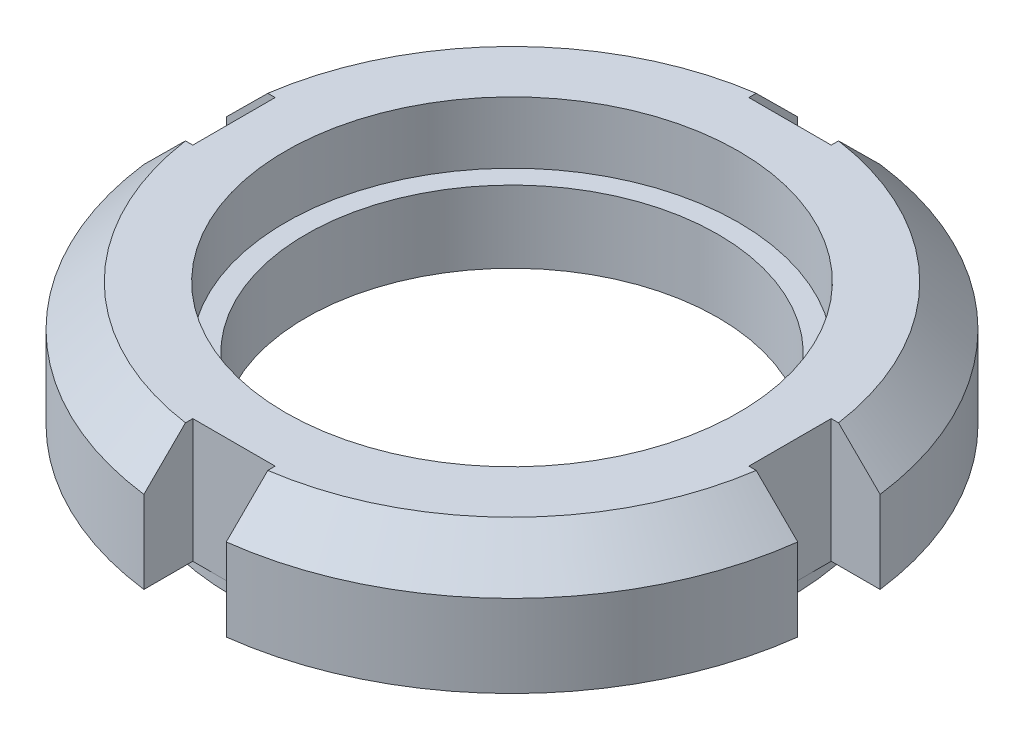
ISO-10303-21;
HEADER;
FILE_DESCRIPTION(('STEP AP214'),'2;1');
FILE_NAME('part.step','',(''),(''),'','','');
FILE_SCHEMA(('AUTOMOTIVE_DESIGN { 1 0 10303 214 1 1 1 1 }'));
ENDSEC;
DATA;
#1=APPLICATION_CONTEXT('core data for automotive mechanical design processes');
#2=APPLICATION_PROTOCOL_DEFINITION('international standard','automotive_design',2000,#1);
#3=PRODUCT_CONTEXT('',#1,'mechanical');
#4=PRODUCT('Part','Part','',(#3));
#5=PRODUCT_RELATED_PRODUCT_CATEGORY('part','',(#4));
#6=PRODUCT_DEFINITION_FORMATION('','',#4);
#7=PRODUCT_DEFINITION_CONTEXT('part definition',#1,'design');
#8=PRODUCT_DEFINITION('design','',#6,#7);
#9=PRODUCT_DEFINITION_SHAPE('','',#8);
#10=(LENGTH_UNIT() NAMED_UNIT(*) SI_UNIT(.MILLI.,.METRE.));
#11=(NAMED_UNIT(*) PLANE_ANGLE_UNIT() SI_UNIT($,.RADIAN.));
#12=(NAMED_UNIT(*) SI_UNIT($,.STERADIAN.) SOLID_ANGLE_UNIT());
#13=UNCERTAINTY_MEASURE_WITH_UNIT(LENGTH_MEASURE(1.E-05),#10,'distance_accuracy_value','');
#14=(GEOMETRIC_REPRESENTATION_CONTEXT(3) GLOBAL_UNCERTAINTY_ASSIGNED_CONTEXT((#13)) GLOBAL_UNIT_ASSIGNED_CONTEXT((#10,
#11,#12)) REPRESENTATION_CONTEXT('',''));
#15=CARTESIAN_POINT('',(0.,0.,0.));
#16=DIRECTION('',(0.,0.,1.));
#17=DIRECTION('',(1.,0.,0.));
#18=AXIS2_PLACEMENT_3D('',#15,#16,#17);
#19=CARTESIAN_POINT('',(13.5000000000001,0.500000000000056,0.));
#20=DIRECTION('',(0.,-1.,0.));
#21=DIRECTION('',(0.,0.,-1.));
#22=AXIS2_PLACEMENT_3D('',#19,#20,#21);
#23=PLANE('',#22);
#24=DIRECTION('',(0.,0.,-1.));
#25=VECTOR('',#24,1.);
#26=CARTESIAN_POINT('',(-2.,0.500000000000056,1.38777878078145E-13));
#27=LINE('',#26,#25);
#28=CARTESIAN_POINT('',(-1.99999999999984,0.499999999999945,15.8745078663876));
#29=VERTEX_POINT('',#28);
#30=CARTESIAN_POINT('',(-1.99999999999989,0.5,13.4999999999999));
#31=VERTEX_POINT('',#30);
#32=EDGE_CURVE('E359',#29,#31,#27,.T.);
#33=ORIENTED_EDGE('',*,*,#32,.F.);
#34=CARTESIAN_POINT('',(0.,0.5,0.));
#35=DIRECTION('',(0.,-1.,0.));
#36=DIRECTION('',(0.,0.,-1.));
#37=AXIS2_PLACEMENT_3D('',#34,#35,#36);
#38=CIRCLE('',#37,16.);
#39=CARTESIAN_POINT('',(-15.8745078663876,0.5,2.00000000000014));
#40=VERTEX_POINT('',#39);
#41=EDGE_CURVE('E325',#29,#40,#38,.T.);
#42=ORIENTED_EDGE('',*,*,#41,.T.);
#43=DIRECTION('',(-1.00000000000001,0.,0.));
#44=VECTOR('',#43,1.);
#45=CARTESIAN_POINT('',(13.5000000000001,0.500000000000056,1.99999999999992));
#46=LINE('',#45,#44);
#47=CARTESIAN_POINT('',(-13.5000000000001,0.500000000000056,2.00000000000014));
#48=VERTEX_POINT('',#47);
#49=EDGE_CURVE('E487',#48,#40,#46,.T.);
#50=ORIENTED_EDGE('',*,*,#49,.F.);
#51=DIRECTION('',(0.,0.,1.));
#52=VECTOR('',#51,1.);
#53=CARTESIAN_POINT('',(-13.5000000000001,0.500000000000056,1.94289029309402E-13));
#54=LINE('',#53,#52);
#55=CARTESIAN_POINT('',(-13.5000000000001,0.500000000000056,1.38777878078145E-13));
#56=VERTEX_POINT('',#55);
#57=EDGE_CURVE('E249',#56,#48,#54,.T.);
#58=ORIENTED_EDGE('',*,*,#57,.F.);
#59=CARTESIAN_POINT('',(0.,0.5,0.));
#60=DIRECTION('',(0.,-1.,0.));
#61=DIRECTION('',(0.,0.,-1.));
#62=AXIS2_PLACEMENT_3D('',#59,#60,#61);
#63=CIRCLE('',#62,13.5);
#64=CARTESIAN_POINT('',(1.11022302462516E-13,0.5,13.5000000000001));
#65=VERTEX_POINT('',#64);
#66=EDGE_CURVE('E330',#65,#56,#63,.T.);
#67=ORIENTED_EDGE('',*,*,#66,.F.);
#68=DIRECTION('',(1.00000000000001,0.,0.));
#69=VECTOR('',#68,1.);
#70=CARTESIAN_POINT('',(13.5000000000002,0.5,13.4999999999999));
#71=LINE('',#70,#69);
#72=EDGE_CURVE('E697',#31,#65,#71,.T.);
#73=ORIENTED_EDGE('',*,*,#72,.F.);
#74=EDGE_LOOP('',(#33,#42,#50,#58,#67,#73));
#75=FACE_BOUND('',#74,.T.);
#76=ADVANCED_FACE('F40',(#75),#23,.T.);
#77=CARTESIAN_POINT('',(0.,1.11022302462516E-13,0.));
#78=DIRECTION('',(0.,-1.,0.));
#79=DIRECTION('',(0.,0.,-1.));
#80=AXIS2_PLACEMENT_3D('',#77,#78,#79);
#81=CYLINDRICAL_SURFACE('',#80,16.);
#82=DIRECTION('',(0.,-1.,0.));
#83=VECTOR('',#82,1.);
#84=CARTESIAN_POINT('',(-1.99999999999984,0.,15.8745078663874));
#85=LINE('',#84,#83);
#86=CARTESIAN_POINT('',(-1.99999999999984,4.5,15.8745078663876));
#87=VERTEX_POINT('',#86);
#88=EDGE_CURVE('E362',#87,#29,#85,.T.);
#89=ORIENTED_EDGE('',*,*,#88,.F.);
#90=CARTESIAN_POINT('',(0.,4.50000000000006,-1.11022302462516E-13));
#91=DIRECTION('',(0.,-1.,0.));
#92=DIRECTION('',(0.,0.,-1.));
#93=AXIS2_PLACEMENT_3D('',#90,#91,#92);
#94=CIRCLE('',#93,16.);
#95=CARTESIAN_POINT('',(-15.8745078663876,4.50000000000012,2.00000000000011));
#96=VERTEX_POINT('',#95);
#97=EDGE_CURVE('E320',#87,#96,#94,.T.);
#98=ORIENTED_EDGE('',*,*,#97,.T.);
#99=DIRECTION('',(0.,-1.,0.));
#100=VECTOR('',#99,1.);
#101=CARTESIAN_POINT('',(-15.8745078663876,0.,2.00000000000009));
#102=LINE('',#101,#100);
#103=EDGE_CURVE('E374',#40,#96,#102,.F.);
#104=ORIENTED_EDGE('',*,*,#103,.F.);
#105=ORIENTED_EDGE('',*,*,#41,.F.);
#106=EDGE_LOOP('',(#89,#98,#104,#105));
#107=FACE_BOUND('',#106,.T.);
#108=ADVANCED_FACE('F433',(#107),#81,.T.);
#109=CARTESIAN_POINT('',(0.,4.50000000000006,-1.11022302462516E-13));
#110=DIRECTION('',(0.,-1.,0.));
#111=DIRECTION('',(0.,0.,-1.));
#112=AXIS2_PLACEMENT_3D('',#109,#110,#111);
#113=CONICAL_SURFACE('',#112,16.,0.78539816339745);
#114=CARTESIAN_POINT('',(-1.99999999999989,10.5013994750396,9.79653063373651));
#115=CARTESIAN_POINT('',(-1.9999999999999,10.1502447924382,10.1549045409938));
#116=CARTESIAN_POINT('',(-1.99999999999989,9.79872175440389,10.51291694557));
#117=CARTESIAN_POINT('',(-1.99999999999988,9.09509243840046,11.2283675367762));
#118=CARTESIAN_POINT('',(-1.99999999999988,8.74298616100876,11.5858057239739));
#119=CARTESIAN_POINT('',(-1.99999999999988,8.03834412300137,12.3002563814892));
#120=CARTESIAN_POINT('',(-1.99999999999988,7.68580836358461,12.6572688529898));
#121=CARTESIAN_POINT('',(-1.99999999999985,6.98039837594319,13.3709594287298));
#122=CARTESIAN_POINT('',(-1.9999999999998,6.62752414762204,13.7276375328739));
#123=CARTESIAN_POINT('',(-1.99999999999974,5.5685112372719,14.7972819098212));
#124=CARTESIAN_POINT('',(-1.99999999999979,4.86198057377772,15.5098600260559));
#125=CARTESIAN_POINT('',(-1.99999999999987,3.44820275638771,16.9343091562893));
#126=CARTESIAN_POINT('',(-1.99999999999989,2.74095560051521,17.6461801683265));
#127=CARTESIAN_POINT('',(-1.99999999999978,2.0335165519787,18.3578596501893));
#128=B_SPLINE_CURVE_WITH_KNOTS('',3,(#114,#115,#116,#117,#118,#119,#120,#121,#122,#123,#124,
#125,#126,#127),.UNSPECIFIED.,.F.,.F.,(4,2,2,2,2,2,4),(0.,1.50521449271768,3.01042749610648,
4.5156363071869,6.02084554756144,9.03125652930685,12.0416758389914),.UNSPECIFIED.);
#129=CARTESIAN_POINT('',(-1.99999999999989,6.50000000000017,13.8564064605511));
#130=VERTEX_POINT('',#129);
#131=EDGE_CURVE('E691',#130,#87,#128,.T.);
#132=ORIENTED_EDGE('',*,*,#131,.F.);
#133=CARTESIAN_POINT('',(0.,6.50000000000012,-1.38777878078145E-13));
#134=DIRECTION('',(0.,-1.,0.));
#135=DIRECTION('',(0.,0.,-1.));
#136=AXIS2_PLACEMENT_3D('',#133,#134,#135);
#137=CIRCLE('',#136,14.);
#138=CARTESIAN_POINT('',(-13.8564064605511,6.50000000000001,2.00000000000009));
#139=VERTEX_POINT('',#138);
#140=EDGE_CURVE('E62',#130,#139,#137,.T.);
#141=ORIENTED_EDGE('',*,*,#140,.T.);
#142=CARTESIAN_POINT('',(-19.8013589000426,0.597894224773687,2.00000000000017));
#143=CARTESIAN_POINT('',(-19.0899827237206,1.30563718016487,2.00000000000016));
#144=CARTESIAN_POINT('',(-18.3784442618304,2.01321729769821,2.00000000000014));
#145=CARTESIAN_POINT('',(-16.9548196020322,3.4278241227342,2.00000000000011));
#146=CARTESIAN_POINT('',(-16.2427334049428,4.13485083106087,2.00000000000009));
#147=CARTESIAN_POINT('',(-14.8177872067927,5.5481259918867,2.00000000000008));
#148=CARTESIAN_POINT('',(-14.1049272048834,6.25437444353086,2.00000000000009));
#149=CARTESIAN_POINT('',(-13.0347301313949,7.31283119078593,2.0000000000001));
#150=CARTESIAN_POINT('',(-12.6778463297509,7.66549771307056,2.0000000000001));
#151=CARTESIAN_POINT('',(-11.9636823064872,8.37042943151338,2.00000000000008));
#152=CARTESIAN_POINT('',(-11.606402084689,8.72269462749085,2.00000000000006));
#153=CARTESIAN_POINT('',(-11.2488766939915,9.0747110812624,2.00000000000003));
#154=B_SPLINE_CURVE_WITH_KNOTS('',3,(#142,#143,#144,#145,#146,#147,#148,#149,#150,#151,#152,
#153),.UNSPECIFIED.,.F.,.F.,(4,2,2,2,2,4),(0.,3.01041640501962,6.02082831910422,9.0312435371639,
10.5364533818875,12.0416639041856),.UNSPECIFIED.);
#155=EDGE_CURVE('E351',#96,#139,#154,.T.);
#156=ORIENTED_EDGE('',*,*,#155,.F.);
#157=ORIENTED_EDGE('',*,*,#97,.F.);
#158=EDGE_LOOP('',(#132,#141,#156,#157));
#159=FACE_BOUND('',#158,.T.);
#160=ADVANCED_FACE('F430',(#159),#113,.T.);
#161=DIRECTION('',(1.00000000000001,0.,0.));
#162=VECTOR('',#161,1.);
#163=CARTESIAN_POINT('',(13.5000000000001,0.5,-2.00000000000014));
#164=LINE('',#163,#162);
#165=CARTESIAN_POINT('',(-15.8745078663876,0.5,-2.00000000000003));
#166=VERTEX_POINT('',#165);
#167=CARTESIAN_POINT('',(-13.5000000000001,0.5,-1.99999999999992));
#168=VERTEX_POINT('',#167);
#169=EDGE_CURVE('E252',#166,#168,#164,.T.);
#170=ORIENTED_EDGE('',*,*,#169,.F.);
#171=CARTESIAN_POINT('',(-2.00000000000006,0.500000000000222,-15.8745078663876));
#172=VERTEX_POINT('',#171);
#173=EDGE_CURVE('E480',#166,#172,#38,.T.);
#174=ORIENTED_EDGE('',*,*,#173,.T.);
#175=DIRECTION('',(0.,0.,-1.));
#176=VECTOR('',#175,1.);
#177=CARTESIAN_POINT('',(-2.,0.5,-1.11022302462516E-13));
#178=LINE('',#177,#176);
#179=CARTESIAN_POINT('',(-2.00000000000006,0.5,-13.5000000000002));
#180=VERTEX_POINT('',#179);
#181=EDGE_CURVE('E514',#180,#172,#178,.T.);
#182=ORIENTED_EDGE('',*,*,#181,.F.);
#183=DIRECTION('',(-1.00000000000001,0.,0.));
#184=VECTOR('',#183,1.);
#185=CARTESIAN_POINT('',(13.5000000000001,0.500000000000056,-13.5000000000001));
#186=LINE('',#185,#184);
#187=CARTESIAN_POINT('',(0.,0.5,-13.5));
#188=VERTEX_POINT('',#187);
#189=EDGE_CURVE('E393',#188,#180,#186,.T.);
#190=ORIENTED_EDGE('',*,*,#189,.F.);
#191=EDGE_CURVE('E517',#56,#188,#63,.T.);
#192=ORIENTED_EDGE('',*,*,#191,.F.);
#193=EDGE_CURVE('E248',#168,#56,#54,.T.);
#194=ORIENTED_EDGE('',*,*,#193,.F.);
#195=EDGE_LOOP('',(#170,#174,#182,#190,#192,#194));
#196=FACE_BOUND('',#195,.T.);
#197=ADVANCED_FACE('F436',(#196),#23,.T.);
#198=DIRECTION('',(0.,-1.,0.));
#199=VECTOR('',#198,1.);
#200=CARTESIAN_POINT('',(-15.8745078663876,0.,-1.99999999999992));
#201=LINE('',#200,#199);
#202=CARTESIAN_POINT('',(-15.8745078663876,4.5,-1.99999999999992));
#203=VERTEX_POINT('',#202);
#204=EDGE_CURVE('E247',#203,#166,#201,.T.);
#205=ORIENTED_EDGE('',*,*,#204,.F.);
#206=CARTESIAN_POINT('',(-2.00000000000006,4.50000000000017,-15.8745078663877));
#207=VERTEX_POINT('',#206);
#208=EDGE_CURVE('E492',#203,#207,#94,.T.);
#209=ORIENTED_EDGE('',*,*,#208,.T.);
#210=DIRECTION('',(0.,-1.,0.));
#211=VECTOR('',#210,1.);
#212=CARTESIAN_POINT('',(-2.00000000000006,1.11022302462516E-13,-15.8745078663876));
#213=LINE('',#212,#211);
#214=EDGE_CURVE('E271',#172,#207,#213,.F.);
#215=ORIENTED_EDGE('',*,*,#214,.F.);
#216=ORIENTED_EDGE('',*,*,#173,.F.);
#217=EDGE_LOOP('',(#205,#209,#215,#216));
#218=FACE_BOUND('',#217,.T.);
#219=ADVANCED_FACE('F442',(#218),#81,.T.);
#220=CARTESIAN_POINT('',(-11.2488766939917,9.0747110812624,-2.00000000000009));
#221=CARTESIAN_POINT('',(-11.6064020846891,8.72269462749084,-1.99999999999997));
#222=CARTESIAN_POINT('',(-11.9636823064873,8.37042943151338,-1.99999999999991));
#223=CARTESIAN_POINT('',(-12.677846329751,7.66549771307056,-1.99999999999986));
#224=CARTESIAN_POINT('',(-13.034730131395,7.31283119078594,-1.99999999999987));
#225=CARTESIAN_POINT('',(-14.1049272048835,6.25437444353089,-1.9999999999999));
#226=CARTESIAN_POINT('',(-14.8177872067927,5.54812599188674,-1.99999999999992));
#227=CARTESIAN_POINT('',(-16.2427334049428,4.13485083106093,-1.99999999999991));
#228=CARTESIAN_POINT('',(-16.9548196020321,3.42782412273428,-1.99999999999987));
#229=CARTESIAN_POINT('',(-18.3784442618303,2.01321729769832,-1.99999999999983));
#230=CARTESIAN_POINT('',(-19.0899827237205,1.30563718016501,-1.99999999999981));
#231=CARTESIAN_POINT('',(-19.8013589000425,0.597894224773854,-1.99999999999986));
#232=B_SPLINE_CURVE_WITH_KNOTS('',3,(#220,#221,#222,#223,#224,#225,#226,#227,#228,#229,#230,
#231),.UNSPECIFIED.,.F.,.F.,(4,2,2,2,2,4),(0.,1.50521052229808,3.01042036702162,
6.02083558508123,9.03124749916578,12.0416639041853),.UNSPECIFIED.);
#233=CARTESIAN_POINT('',(-13.8564064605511,6.50000000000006,-2.00000000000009));
#234=VERTEX_POINT('',#233);
#235=EDGE_CURVE('E240',#234,#203,#232,.T.);
#236=ORIENTED_EDGE('',*,*,#235,.F.);
#237=CARTESIAN_POINT('',(-2.00000000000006,6.50000000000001,-13.8564064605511));
#238=VERTEX_POINT('',#237);
#239=EDGE_CURVE('E506',#234,#238,#137,.T.);
#240=ORIENTED_EDGE('',*,*,#239,.T.);
#241=CARTESIAN_POINT('',(-2.00000000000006,0.597894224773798,-19.8013589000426));
#242=CARTESIAN_POINT('',(-2.0000000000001,1.30563718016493,-19.0899827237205));
#243=CARTESIAN_POINT('',(-2.00000000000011,2.01321729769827,-18.3784442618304));
#244=CARTESIAN_POINT('',(-2.00000000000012,3.4278241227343,-16.9548196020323));
#245=CARTESIAN_POINT('',(-2.00000000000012,4.13485083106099,-16.242733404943));
#246=CARTESIAN_POINT('',(-2.00000000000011,5.54812599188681,-14.8177872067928));
#247=CARTESIAN_POINT('',(-2.0000000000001,6.25437444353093,-14.1049272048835));
#248=CARTESIAN_POINT('',(-2.0000000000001,7.31283119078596,-13.034730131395));
#249=CARTESIAN_POINT('',(-2.0000000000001,7.66549771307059,-12.677846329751));
#250=CARTESIAN_POINT('',(-2.00000000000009,8.37042943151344,-11.9636823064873));
#251=CARTESIAN_POINT('',(-2.00000000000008,8.72269462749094,-11.6064020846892));
#252=CARTESIAN_POINT('',(-2.00000000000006,9.07471108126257,-11.2488766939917));
#253=B_SPLINE_CURVE_WITH_KNOTS('',3,(#241,#242,#243,#244,#245,#246,#247,#248,#249,#250,#251,
#252),.UNSPECIFIED.,.F.,.F.,(4,2,2,2,2,4),(0.,3.01041640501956,6.02082831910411,
9.03124353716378,10.5364533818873,12.0416639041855),.UNSPECIFIED.);
#254=EDGE_CURVE('E262',#207,#238,#253,.T.);
#255=ORIENTED_EDGE('',*,*,#254,.F.);
#256=ORIENTED_EDGE('',*,*,#208,.F.);
#257=EDGE_LOOP('',(#236,#240,#255,#256));
#258=FACE_BOUND('',#257,.T.);
#259=ADVANCED_FACE('F460',(#258),#113,.T.);
#260=DIRECTION('',(0.,0.,1.));
#261=VECTOR('',#260,1.);
#262=CARTESIAN_POINT('',(2.,0.5,-1.38777878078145E-13));
#263=LINE('',#262,#261);
#264=CARTESIAN_POINT('',(1.99999999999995,0.5,-15.8745078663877));
#265=VERTEX_POINT('',#264);
#266=CARTESIAN_POINT('',(1.99999999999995,0.500000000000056,-13.5000000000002));
#267=VERTEX_POINT('',#266);
#268=EDGE_CURVE('E395',#265,#267,#263,.T.);
#269=ORIENTED_EDGE('',*,*,#268,.F.);
#270=CARTESIAN_POINT('',(15.8745078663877,0.500000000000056,-1.99999999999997));
#271=VERTEX_POINT('',#270);
#272=EDGE_CURVE('E319',#265,#271,#38,.T.);
#273=ORIENTED_EDGE('',*,*,#272,.T.);
#274=DIRECTION('',(1.00000000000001,0.,0.));
#275=VECTOR('',#274,1.);
#276=CARTESIAN_POINT('',(13.5000000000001,0.500000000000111,-2.00000000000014));
#277=LINE('',#276,#275);
#278=CARTESIAN_POINT('',(13.5000000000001,0.500000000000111,-2.00000000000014));
#279=VERTEX_POINT('',#278);
#280=EDGE_CURVE('E503',#279,#271,#277,.T.);
#281=ORIENTED_EDGE('',*,*,#280,.F.);
#282=DIRECTION('',(0.,0.,-1.));
#283=VECTOR('',#282,1.);
#284=CARTESIAN_POINT('',(13.5000000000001,0.500000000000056,0.));
#285=LINE('',#284,#283);
#286=CARTESIAN_POINT('',(13.5000000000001,0.500000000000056,0.));
#287=VERTEX_POINT('',#286);
#288=EDGE_CURVE('E298',#287,#279,#285,.T.);
#289=ORIENTED_EDGE('',*,*,#288,.F.);
#290=EDGE_CURVE('E324',#188,#287,#63,.T.);
#291=ORIENTED_EDGE('',*,*,#290,.F.);
#292=EDGE_CURVE('E392',#267,#188,#186,.T.);
#293=ORIENTED_EDGE('',*,*,#292,.F.);
#294=EDGE_LOOP('',(#269,#273,#281,#289,#291,#293));
#295=FACE_BOUND('',#294,.T.);
#296=ADVANCED_FACE('F447',(#295),#23,.T.);
#297=DIRECTION('',(0.,-1.,0.));
#298=VECTOR('',#297,1.);
#299=CARTESIAN_POINT('',(2.,0.,-15.8745078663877));
#300=LINE('',#299,#298);
#301=CARTESIAN_POINT('',(2.,4.50000000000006,-15.8745078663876));
#302=VERTEX_POINT('',#301);
#303=EDGE_CURVE('E391',#302,#265,#300,.T.);
#304=ORIENTED_EDGE('',*,*,#303,.F.);
#305=CARTESIAN_POINT('',(15.8745078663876,4.49999999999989,-2.00000000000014));
#306=VERTEX_POINT('',#305);
#307=EDGE_CURVE('E315',#302,#306,#94,.T.);
#308=ORIENTED_EDGE('',*,*,#307,.T.);
#309=DIRECTION('',(0.,-1.,0.));
#310=VECTOR('',#309,1.);
#311=CARTESIAN_POINT('',(15.8745078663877,0.,-2.00000000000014));
#312=LINE('',#311,#310);
#313=EDGE_CURVE('E413',#271,#306,#312,.F.);
#314=ORIENTED_EDGE('',*,*,#313,.F.);
#315=ORIENTED_EDGE('',*,*,#272,.F.);
#316=EDGE_LOOP('',(#304,#308,#314,#315));
#317=FACE_BOUND('',#316,.T.);
#318=ADVANCED_FACE('F456',(#317),#81,.T.);
#319=CARTESIAN_POINT('',(2.,9.07471108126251,-11.2488766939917));
#320=CARTESIAN_POINT('',(1.99999999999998,8.72269462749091,-11.6064020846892));
#321=CARTESIAN_POINT('',(1.99999999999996,8.37042943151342,-11.9636823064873));
#322=CARTESIAN_POINT('',(1.99999999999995,7.66549771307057,-12.677846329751));
#323=CARTESIAN_POINT('',(1.99999999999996,7.31283119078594,-13.034730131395));
#324=CARTESIAN_POINT('',(1.99999999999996,6.25437444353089,-14.1049272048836));
#325=CARTESIAN_POINT('',(1.99999999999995,5.54812599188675,-14.8177872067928));
#326=CARTESIAN_POINT('',(1.99999999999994,4.13485083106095,-16.242733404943));
#327=CARTESIAN_POINT('',(1.99999999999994,3.4278241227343,-16.9548196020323));
#328=CARTESIAN_POINT('',(1.99999999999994,2.01321729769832,-18.3784442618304));
#329=CARTESIAN_POINT('',(1.99999999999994,1.305637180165,-19.0899827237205));
#330=CARTESIAN_POINT('',(1.99999999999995,0.597894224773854,-19.8013589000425));
#331=B_SPLINE_CURVE_WITH_KNOTS('',3,(#319,#320,#321,#322,#323,#324,#325,#326,#327,#328,#329,
#330),.UNSPECIFIED.,.F.,.F.,(4,2,2,2,2,4),(0.,1.50521052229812,3.01042036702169,
6.02083558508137,9.03124749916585,12.0416639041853),.UNSPECIFIED.);
#332=CARTESIAN_POINT('',(1.99999999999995,6.50000000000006,-13.8564064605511));
#333=VERTEX_POINT('',#332);
#334=EDGE_CURVE('E384',#333,#302,#331,.T.);
#335=ORIENTED_EDGE('',*,*,#334,.F.);
#336=CARTESIAN_POINT('',(13.8564064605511,6.50000000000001,-2.0000000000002));
#337=VERTEX_POINT('',#336);
#338=EDGE_CURVE('E312',#333,#337,#137,.T.);
#339=ORIENTED_EDGE('',*,*,#338,.T.);
#340=CARTESIAN_POINT('',(18.3578596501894,2.03351655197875,-2.0000000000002));
#341=CARTESIAN_POINT('',(17.6461801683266,2.74095560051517,-2.00000000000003));
#342=CARTESIAN_POINT('',(16.9343091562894,3.44820275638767,-2.));
#343=CARTESIAN_POINT('',(15.509860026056,4.86198057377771,-2.));
#344=CARTESIAN_POINT('',(14.7972819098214,5.56851123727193,-2.00000000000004));
#345=CARTESIAN_POINT('',(13.727637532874,6.62752414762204,-2.00000000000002));
#346=CARTESIAN_POINT('',(13.3709594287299,6.98039837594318,-2.));
#347=CARTESIAN_POINT('',(12.6572688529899,7.68580836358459,-1.99999999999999));
#348=CARTESIAN_POINT('',(12.3002563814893,8.03834412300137,-2.));
#349=CARTESIAN_POINT('',(11.585805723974,8.74298616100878,-2.));
#350=CARTESIAN_POINT('',(11.2283675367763,9.09509243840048,-1.99999999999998));
#351=CARTESIAN_POINT('',(10.5129169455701,9.79872175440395,-2.00000000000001));
#352=CARTESIAN_POINT('',(10.1549045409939,10.1502447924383,-2.00000000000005));
#353=CARTESIAN_POINT('',(9.79653063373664,10.5013994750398,-2.00000000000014));
#354=B_SPLINE_CURVE_WITH_KNOTS('',3,(#340,#341,#342,#343,#344,#345,#346,#347,#348,#349,#350,
#351,#352,#353),.UNSPECIFIED.,.F.,.F.,(4,2,2,2,2,2,4),(0.,3.01041930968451,6.02083029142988,
7.52603953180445,9.03124834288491,10.5364613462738,12.0416758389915),.UNSPECIFIED.);
#355=EDGE_CURVE('E405',#306,#337,#354,.T.);
#356=ORIENTED_EDGE('',*,*,#355,.F.);
#357=ORIENTED_EDGE('',*,*,#307,.F.);
#358=EDGE_LOOP('',(#335,#339,#356,#357));
#359=FACE_BOUND('',#358,.T.);
#360=ADVANCED_FACE('F431',(#359),#113,.T.);
#361=CARTESIAN_POINT('',(0.,1.11022302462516E-13,0.));
#362=DIRECTION('',(0.,-1.,0.));
#363=DIRECTION('',(0.,0.,-1.));
#364=AXIS2_PLACEMENT_3D('',#361,#362,#363);
#365=CYLINDRICAL_SURFACE('',#364,10.);
#366=CARTESIAN_POINT('',(0.,1.11022302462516E-13,0.));
#367=DIRECTION('',(0.,-1.,0.));
#368=DIRECTION('',(0.,0.,-1.));
#369=AXIS2_PLACEMENT_3D('',#366,#367,#368);
#370=CIRCLE('',#369,10.);
#371=CARTESIAN_POINT('',(0.,1.1518563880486E-13,-10.0000000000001));
#372=VERTEX_POINT('',#371);
#373=EDGE_CURVE('E333',#372,#372,#370,.T.);
#374=ORIENTED_EDGE('',*,*,#373,.T.);
#375=EDGE_LOOP('',(#374));
#376=FACE_BOUND('',#375,.T.);
#377=CARTESIAN_POINT('',(0.,3.50000000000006,-1.38777878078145E-13));
#378=DIRECTION('',(0.,-1.,0.));
#379=DIRECTION('',(0.,0.,-1.));
#380=AXIS2_PLACEMENT_3D('',#377,#378,#379);
#381=CIRCLE('',#380,10.);
#382=CARTESIAN_POINT('',(0.,3.50000000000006,-10.0000000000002));
#383=VERTEX_POINT('',#382);
#384=EDGE_CURVE('E303',#383,#383,#381,.T.);
#385=ORIENTED_EDGE('',*,*,#384,.F.);
#386=EDGE_LOOP('',(#385));
#387=FACE_BOUND('',#386,.T.);
#388=ADVANCED_FACE('F42',(#376,#387),#365,.F.);
#389=CARTESIAN_POINT('',(10.0000000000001,0.,-1.94289029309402E-13));
#390=DIRECTION('',(0.,-1.,0.));
#391=DIRECTION('',(0.,0.,-1.));
#392=AXIS2_PLACEMENT_3D('',#389,#390,#391);
#393=PLANE('',#392);
#394=CARTESIAN_POINT('',(0.,1.11022302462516E-13,0.));
#395=DIRECTION('',(0.,-1.,0.));
#396=DIRECTION('',(0.,0.,-1.));
#397=AXIS2_PLACEMENT_3D('',#394,#395,#396);
#398=CIRCLE('',#397,13.5);
#399=CARTESIAN_POINT('',(0.,1.16642806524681E-13,-13.5000000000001));
#400=VERTEX_POINT('',#399);
#401=EDGE_CURVE('E329',#400,#400,#398,.T.);
#402=ORIENTED_EDGE('',*,*,#401,.T.);
#403=EDGE_LOOP('',(#402));
#404=FACE_BOUND('',#403,.T.);
#405=ORIENTED_EDGE('',*,*,#373,.F.);
#406=EDGE_LOOP('',(#405));
#407=FACE_BOUND('',#406,.T.);
#408=ADVANCED_FACE('F457',(#404,#407),#393,.T.);
#409=CARTESIAN_POINT('',(0.,1.11022302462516E-13,0.));
#410=DIRECTION('',(0.,-1.,0.));
#411=DIRECTION('',(0.,0.,-1.));
#412=AXIS2_PLACEMENT_3D('',#409,#410,#411);
#413=CYLINDRICAL_SURFACE('',#412,13.5);
#414=EDGE_CURVE('E326',#287,#65,#63,.T.);
#415=ORIENTED_EDGE('',*,*,#414,.T.);
#416=ORIENTED_EDGE('',*,*,#66,.T.);
#417=ORIENTED_EDGE('',*,*,#191,.T.);
#418=ORIENTED_EDGE('',*,*,#290,.T.);
#419=EDGE_LOOP('',(#415,#416,#417,#418));
#420=FACE_BOUND('',#419,.T.);
#421=ORIENTED_EDGE('',*,*,#401,.F.);
#422=EDGE_LOOP('',(#421));
#423=FACE_BOUND('',#422,.T.);
#424=ADVANCED_FACE('F449',(#420,#423),#413,.T.);
#425=CARTESIAN_POINT('',(2.00000000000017,0.5,13.5));
#426=VERTEX_POINT('',#425);
#427=EDGE_CURVE('E198',#65,#426,#71,.T.);
#428=ORIENTED_EDGE('',*,*,#427,.F.);
#429=ORIENTED_EDGE('',*,*,#414,.F.);
#430=CARTESIAN_POINT('',(13.5000000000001,0.5,2.00000000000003));
#431=VERTEX_POINT('',#430);
#432=EDGE_CURVE('E297',#431,#287,#285,.T.);
#433=ORIENTED_EDGE('',*,*,#432,.F.);
#434=DIRECTION('',(-1.00000000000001,0.,0.));
#435=VECTOR('',#434,1.);
#436=CARTESIAN_POINT('',(13.5000000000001,0.5,2.00000000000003));
#437=LINE('',#436,#435);
#438=CARTESIAN_POINT('',(15.8745078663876,0.5,2.));
#439=VERTEX_POINT('',#438);
#440=EDGE_CURVE('E301',#439,#431,#437,.T.);
#441=ORIENTED_EDGE('',*,*,#440,.F.);
#442=CARTESIAN_POINT('',(2.00000000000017,0.499999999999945,15.8745078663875));
#443=VERTEX_POINT('',#442);
#444=EDGE_CURVE('E321',#439,#443,#38,.T.);
#445=ORIENTED_EDGE('',*,*,#444,.T.);
#446=DIRECTION('',(0.,0.,1.));
#447=VECTOR('',#446,1.);
#448=CARTESIAN_POINT('',(2.,0.5,0.));
#449=LINE('',#448,#447);
#450=EDGE_CURVE('E719',#426,#443,#449,.T.);
#451=ORIENTED_EDGE('',*,*,#450,.F.);
#452=EDGE_LOOP('',(#428,#429,#433,#441,#445,#451));
#453=FACE_BOUND('',#452,.T.);
#454=ADVANCED_FACE('F437',(#453),#23,.T.);
#455=DIRECTION('',(0.,-1.,0.));
#456=VECTOR('',#455,1.);
#457=CARTESIAN_POINT('',(2.00000000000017,-1.66533453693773E-13,15.8745078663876));
#458=LINE('',#457,#456);
#459=CARTESIAN_POINT('',(2.00000000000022,4.49999999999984,15.8745078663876));
#460=VERTEX_POINT('',#459);
#461=EDGE_CURVE('E220',#443,#460,#458,.F.);
#462=ORIENTED_EDGE('',*,*,#461,.F.);
#463=ORIENTED_EDGE('',*,*,#444,.F.);
#464=DIRECTION('',(0.,-1.,0.));
#465=VECTOR('',#464,1.);
#466=CARTESIAN_POINT('',(15.8745078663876,0.,1.99999999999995));
#467=LINE('',#466,#465);
#468=CARTESIAN_POINT('',(15.8745078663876,4.50000000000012,1.99999999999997));
#469=VERTEX_POINT('',#468);
#470=EDGE_CURVE('E296',#469,#439,#467,.T.);
#471=ORIENTED_EDGE('',*,*,#470,.F.);
#472=EDGE_CURVE('E316',#469,#460,#94,.T.);
#473=ORIENTED_EDGE('',*,*,#472,.T.);
#474=EDGE_LOOP('',(#462,#463,#471,#473));
#475=FACE_BOUND('',#474,.T.);
#476=ADVANCED_FACE('F428',(#475),#81,.T.);
#477=CARTESIAN_POINT('',(2.00000000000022,2.03351655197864,18.3578596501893));
#478=CARTESIAN_POINT('',(2.00000000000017,2.7409556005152,17.6461801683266));
#479=CARTESIAN_POINT('',(2.00000000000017,3.44820275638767,16.9343091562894));
#480=CARTESIAN_POINT('',(2.00000000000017,4.86198057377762,15.5098600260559));
#481=CARTESIAN_POINT('',(2.00000000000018,5.56851123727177,14.7972819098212));
#482=CARTESIAN_POINT('',(2.00000000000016,6.62752414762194,13.7276375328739));
#483=CARTESIAN_POINT('',(2.00000000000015,6.98039837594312,13.3709594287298));
#484=CARTESIAN_POINT('',(2.00000000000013,7.68580836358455,12.6572688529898));
#485=CARTESIAN_POINT('',(2.00000000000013,8.03834412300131,12.3002563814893));
#486=CARTESIAN_POINT('',(2.00000000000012,8.7429861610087,11.5858057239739));
#487=CARTESIAN_POINT('',(2.00000000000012,9.09509243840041,11.2283675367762));
#488=CARTESIAN_POINT('',(2.00000000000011,9.79872175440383,10.51291694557));
#489=CARTESIAN_POINT('',(2.00000000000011,10.1502447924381,10.1549045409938));
#490=CARTESIAN_POINT('',(2.00000000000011,10.5013994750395,9.79653063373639));
#491=B_SPLINE_CURVE_WITH_KNOTS('',3,(#477,#478,#479,#480,#481,#482,#483,#484,#485,#486,#487,
#488,#489,#490),.UNSPECIFIED.,.F.,.F.,(4,2,2,2,2,2,4),(0.,3.01041930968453,6.02083029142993,
7.52603953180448,9.03124834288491,10.5364613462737,12.0416758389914),.UNSPECIFIED.);
#492=CARTESIAN_POINT('',(2.00000000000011,6.50000000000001,13.8564064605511));
#493=VERTEX_POINT('',#492);
#494=EDGE_CURVE('E54',#460,#493,#491,.T.);
#495=ORIENTED_EDGE('',*,*,#494,.F.);
#496=ORIENTED_EDGE('',*,*,#472,.F.);
#497=CARTESIAN_POINT('',(9.79653063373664,10.5013994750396,1.99999999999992));
#498=CARTESIAN_POINT('',(10.154904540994,10.1502447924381,1.99999999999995));
#499=CARTESIAN_POINT('',(10.5129169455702,9.79872175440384,1.99999999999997));
#500=CARTESIAN_POINT('',(11.2283675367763,9.09509243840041,1.99999999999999));
#501=CARTESIAN_POINT('',(11.585805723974,8.74298616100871,1.99999999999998));
#502=CARTESIAN_POINT('',(12.3002563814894,8.03834412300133,1.99999999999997));
#503=CARTESIAN_POINT('',(12.6572688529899,7.68580836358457,1.99999999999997));
#504=CARTESIAN_POINT('',(13.3709594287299,6.98039837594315,1.99999999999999));
#505=CARTESIAN_POINT('',(13.727637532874,6.62752414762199,2.00000000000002));
#506=CARTESIAN_POINT('',(14.7972819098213,5.56851123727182,2.00000000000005));
#507=CARTESIAN_POINT('',(15.509860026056,4.86198057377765,2.00000000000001));
#508=CARTESIAN_POINT('',(16.9343091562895,3.44820275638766,1.99999999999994));
#509=CARTESIAN_POINT('',(17.6461801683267,2.74095560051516,1.99999999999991));
#510=CARTESIAN_POINT('',(18.3578596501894,2.03351655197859,1.99999999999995));
#511=B_SPLINE_CURVE_WITH_KNOTS('',3,(#497,#498,#499,#500,#501,#502,#503,#504,#505,#506,#507,
#508,#509,#510),.UNSPECIFIED.,.F.,.F.,(4,2,2,2,2,2,4),(0.,1.50521449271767,3.01042749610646,
4.51563630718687,6.0208455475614,9.03125652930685,12.0416758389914),.UNSPECIFIED.);
#512=CARTESIAN_POINT('',(13.8564064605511,6.50000000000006,1.99999999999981));
#513=VERTEX_POINT('',#512);
#514=EDGE_CURVE('E289',#513,#469,#511,.T.);
#515=ORIENTED_EDGE('',*,*,#514,.F.);
#516=EDGE_CURVE('E313',#513,#493,#137,.T.);
#517=ORIENTED_EDGE('',*,*,#516,.T.);
#518=EDGE_LOOP('',(#495,#496,#515,#517));
#519=FACE_BOUND('',#518,.T.);
#520=ADVANCED_FACE('F222',(#519),#113,.T.);
#521=CARTESIAN_POINT('',(14.0000000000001,6.50000000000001,0.));
#522=DIRECTION('',(0.,1.,0.));
#523=DIRECTION('',(0.,0.,1.));
#524=AXIS2_PLACEMENT_3D('',#521,#522,#523);
#525=PLANE('',#524);
#526=DIRECTION('',(0.,0.,1.));
#527=VECTOR('',#526,1.);
#528=CARTESIAN_POINT('',(-1.99999999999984,6.50000000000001,16.0000000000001));
#529=LINE('',#528,#527);
#530=CARTESIAN_POINT('',(-1.99999999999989,6.50000000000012,13.5000000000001));
#531=VERTEX_POINT('',#530);
#532=EDGE_CURVE('E201',#531,#130,#529,.T.);
#533=ORIENTED_EDGE('',*,*,#532,.F.);
#534=DIRECTION('',(-1.00000000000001,0.,0.));
#535=VECTOR('',#534,1.);
#536=CARTESIAN_POINT('',(2.00000000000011,6.50000000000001,13.5000000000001));
#537=LINE('',#536,#535);
#538=CARTESIAN_POINT('',(2.00000000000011,6.50000000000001,13.5000000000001));
#539=VERTEX_POINT('',#538);
#540=EDGE_CURVE('E195',#539,#531,#537,.T.);
#541=ORIENTED_EDGE('',*,*,#540,.F.);
#542=DIRECTION('',(0.,0.,-1.));
#543=VECTOR('',#542,1.);
#544=CARTESIAN_POINT('',(2.,6.50000000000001,0.));
#545=LINE('',#544,#543);
#546=EDGE_CURVE('E11',#493,#539,#545,.T.);
#547=ORIENTED_EDGE('',*,*,#546,.F.);
#548=ORIENTED_EDGE('',*,*,#516,.F.);
#549=DIRECTION('',(1.00000000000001,0.,0.));
#550=VECTOR('',#549,1.);
#551=CARTESIAN_POINT('',(16.0000000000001,6.50000000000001,1.99999999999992));
#552=LINE('',#551,#550);
#553=CARTESIAN_POINT('',(13.5000000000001,6.50000000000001,1.99999999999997));
#554=VERTEX_POINT('',#553);
#555=EDGE_CURVE('E400',#554,#513,#552,.T.);
#556=ORIENTED_EDGE('',*,*,#555,.F.);
#557=DIRECTION('',(0.,0.,1.));
#558=VECTOR('',#557,1.);
#559=CARTESIAN_POINT('',(13.5000000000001,6.50000000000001,-2.00000000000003));
#560=LINE('',#559,#558);
#561=CARTESIAN_POINT('',(13.5000000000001,6.50000000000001,-2.00000000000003));
#562=VERTEX_POINT('',#561);
#563=EDGE_CURVE('E397',#562,#554,#560,.T.);
#564=ORIENTED_EDGE('',*,*,#563,.F.);
#565=DIRECTION('',(-1.00000000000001,0.,0.));
#566=VECTOR('',#565,1.);
#567=CARTESIAN_POINT('',(14.0000000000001,6.50000000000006,-2.00000000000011));
#568=LINE('',#567,#566);
#569=EDGE_CURVE('E336',#337,#562,#568,.T.);
#570=ORIENTED_EDGE('',*,*,#569,.F.);
#571=ORIENTED_EDGE('',*,*,#338,.F.);
#572=DIRECTION('',(0.,0.,-1.));
#573=VECTOR('',#572,1.);
#574=CARTESIAN_POINT('',(2.,6.50000000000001,-16.));
#575=LINE('',#574,#573);
#576=CARTESIAN_POINT('',(1.99999999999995,6.50000000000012,-13.5000000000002));
#577=VERTEX_POINT('',#576);
#578=EDGE_CURVE('E257',#577,#333,#575,.T.);
#579=ORIENTED_EDGE('',*,*,#578,.F.);
#580=DIRECTION('',(1.00000000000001,0.,0.));
#581=VECTOR('',#580,1.);
#582=CARTESIAN_POINT('',(-2.00000000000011,6.50000000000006,-13.5000000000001));
#583=LINE('',#582,#581);
#584=CARTESIAN_POINT('',(-2.00000000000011,6.50000000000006,-13.5000000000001));
#585=VERTEX_POINT('',#584);
#586=EDGE_CURVE('E254',#585,#577,#583,.T.);
#587=ORIENTED_EDGE('',*,*,#586,.F.);
#588=DIRECTION('',(0.,0.,1.));
#589=VECTOR('',#588,1.);
#590=CARTESIAN_POINT('',(-2.,6.50000000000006,0.));
#591=LINE('',#590,#589);
#592=EDGE_CURVE('E339',#238,#585,#591,.T.);
#593=ORIENTED_EDGE('',*,*,#592,.F.);
#594=ORIENTED_EDGE('',*,*,#239,.F.);
#595=DIRECTION('',(-1.00000000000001,0.,0.));
#596=VECTOR('',#595,1.);
#597=CARTESIAN_POINT('',(-16.0000000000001,6.50000000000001,-1.99999999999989));
#598=LINE('',#597,#596);
#599=CARTESIAN_POINT('',(-13.5000000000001,6.50000000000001,-1.99999999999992));
#600=VERTEX_POINT('',#599);
#601=EDGE_CURVE('E356',#600,#234,#598,.T.);
#602=ORIENTED_EDGE('',*,*,#601,.F.);
#603=DIRECTION('',(0.,0.,-1.));
#604=VECTOR('',#603,1.);
#605=CARTESIAN_POINT('',(-13.5000000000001,6.50000000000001,1.99999999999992));
#606=LINE('',#605,#604);
#607=CARTESIAN_POINT('',(-13.5000000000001,6.50000000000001,1.99999999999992));
#608=VERTEX_POINT('',#607);
#609=EDGE_CURVE('E354',#608,#600,#606,.T.);
#610=ORIENTED_EDGE('',*,*,#609,.F.);
#611=DIRECTION('',(1.00000000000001,0.,0.));
#612=VECTOR('',#611,1.);
#613=CARTESIAN_POINT('',(14.0000000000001,6.50000000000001,1.99999999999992));
#614=LINE('',#613,#612);
#615=EDGE_CURVE('E48',#139,#608,#614,.T.);
#616=ORIENTED_EDGE('',*,*,#615,.F.);
#617=ORIENTED_EDGE('',*,*,#140,.F.);
#618=EDGE_LOOP('',(#533,#541,#547,#548,#556,#564,#570,#571,#579,#587,#593,#594,#602,#610,#616,#617));
#619=FACE_BOUND('',#618,.T.);
#620=CARTESIAN_POINT('',(0.,6.50000000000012,-1.38777878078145E-13));
#621=DIRECTION('',(0.,-1.,0.));
#622=DIRECTION('',(0.,0.,-1.));
#623=AXIS2_PLACEMENT_3D('',#620,#621,#622);
#624=CIRCLE('',#623,11.);
#625=CARTESIAN_POINT('',(0.,6.50000000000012,-11.0000000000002));
#626=VERTEX_POINT('',#625);
#627=EDGE_CURVE('E309',#626,#626,#624,.T.);
#628=ORIENTED_EDGE('',*,*,#627,.T.);
#629=EDGE_LOOP('',(#628));
#630=FACE_BOUND('',#629,.T.);
#631=ADVANCED_FACE('F207',(#619,#630),#525,.T.);
#632=CARTESIAN_POINT('',(0.,1.11022302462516E-13,0.));
#633=DIRECTION('',(0.,-1.,0.));
#634=DIRECTION('',(0.,0.,-1.));
#635=AXIS2_PLACEMENT_3D('',#632,#633,#634);
#636=CYLINDRICAL_SURFACE('',#635,11.);
#637=CARTESIAN_POINT('',(0.,3.50000000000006,-1.38777878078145E-13));
#638=DIRECTION('',(0.,-1.,0.));
#639=DIRECTION('',(0.,0.,-1.));
#640=AXIS2_PLACEMENT_3D('',#637,#638,#639);
#641=CIRCLE('',#640,11.);
#642=CARTESIAN_POINT('',(0.,3.50000000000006,-11.0000000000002));
#643=VERTEX_POINT('',#642);
#644=EDGE_CURVE('E306',#643,#643,#641,.T.);
#645=ORIENTED_EDGE('',*,*,#644,.T.);
#646=EDGE_LOOP('',(#645));
#647=FACE_BOUND('',#646,.T.);
#648=ORIENTED_EDGE('',*,*,#627,.F.);
#649=EDGE_LOOP('',(#648));
#650=FACE_BOUND('',#649,.T.);
#651=ADVANCED_FACE('F420',(#647,#650),#636,.F.);
#652=CARTESIAN_POINT('',(11.0000000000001,3.5,0.));
#653=DIRECTION('',(0.,1.,0.));
#654=DIRECTION('',(0.,0.,1.));
#655=AXIS2_PLACEMENT_3D('',#652,#653,#654);
#656=PLANE('',#655);
#657=ORIENTED_EDGE('',*,*,#384,.T.);
#658=EDGE_LOOP('',(#657));
#659=FACE_BOUND('',#658,.T.);
#660=ORIENTED_EDGE('',*,*,#644,.F.);
#661=EDGE_LOOP('',(#660));
#662=FACE_BOUND('',#661,.T.);
#663=ADVANCED_FACE('F285',(#659,#662),#656,.T.);
#664=CARTESIAN_POINT('',(16.0000000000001,0.,1.99999999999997));
#665=DIRECTION('',(0.,0.,1.));
#666=DIRECTION('',(1.00000000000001,0.,0.));
#667=AXIS2_PLACEMENT_3D('',#664,#665,#666);
#668=PLANE('',#667);
#669=ORIENTED_EDGE('',*,*,#440,.T.);
#670=DIRECTION('',(0.,1.,0.));
#671=VECTOR('',#670,1.);
#672=CARTESIAN_POINT('',(13.5000000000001,0.,1.99999999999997));
#673=LINE('',#672,#671);
#674=EDGE_CURVE('E403',#431,#554,#673,.T.);
#675=ORIENTED_EDGE('',*,*,#674,.T.);
#676=ORIENTED_EDGE('',*,*,#555,.T.);
#677=ORIENTED_EDGE('',*,*,#514,.T.);
#678=ORIENTED_EDGE('',*,*,#470,.T.);
#679=EDGE_LOOP('',(#669,#675,#676,#677,#678));
#680=FACE_BOUND('',#679,.T.);
#681=ADVANCED_FACE('F280',(#680),#668,.F.);
#682=CARTESIAN_POINT('',(13.5000000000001,0.,-2.00000000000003));
#683=DIRECTION('',(-1.00000000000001,0.,0.));
#684=DIRECTION('',(0.,0.,1.));
#685=AXIS2_PLACEMENT_3D('',#682,#683,#684);
#686=PLANE('',#685);
#687=ORIENTED_EDGE('',*,*,#432,.T.);
#688=ORIENTED_EDGE('',*,*,#288,.T.);
#689=DIRECTION('',(0.,1.,0.));
#690=VECTOR('',#689,1.);
#691=CARTESIAN_POINT('',(13.5000000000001,0.,-2.00000000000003));
#692=LINE('',#691,#690);
#693=EDGE_CURVE('E402',#279,#562,#692,.T.);
#694=ORIENTED_EDGE('',*,*,#693,.T.);
#695=ORIENTED_EDGE('',*,*,#563,.T.);
#696=ORIENTED_EDGE('',*,*,#674,.F.);
#697=EDGE_LOOP('',(#687,#688,#694,#695,#696));
#698=FACE_BOUND('',#697,.T.);
#699=ADVANCED_FACE('F284',(#698),#686,.F.);
#700=CARTESIAN_POINT('',(16.,0.,-2.));
#701=DIRECTION('',(0.,0.,-1.));
#702=DIRECTION('',(-1.00000000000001,0.,0.));
#703=AXIS2_PLACEMENT_3D('',#700,#701,#702);
#704=PLANE('',#703);
#705=ORIENTED_EDGE('',*,*,#280,.T.);
#706=ORIENTED_EDGE('',*,*,#313,.T.);
#707=ORIENTED_EDGE('',*,*,#355,.T.);
#708=ORIENTED_EDGE('',*,*,#569,.T.);
#709=ORIENTED_EDGE('',*,*,#693,.F.);
#710=EDGE_LOOP('',(#705,#706,#707,#708,#709));
#711=FACE_BOUND('',#710,.T.);
#712=ADVANCED_FACE('F381',(#711),#704,.F.);
#713=CARTESIAN_POINT('',(1.99999999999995,0.,-16.0000000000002));
#714=DIRECTION('',(1.00000000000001,0.,0.));
#715=DIRECTION('',(0.,0.,-1.));
#716=AXIS2_PLACEMENT_3D('',#713,#714,#715);
#717=PLANE('',#716);
#718=ORIENTED_EDGE('',*,*,#268,.T.);
#719=DIRECTION('',(0.,1.,0.));
#720=VECTOR('',#719,1.);
#721=CARTESIAN_POINT('',(1.99999999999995,1.11022302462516E-13,-13.5000000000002));
#722=LINE('',#721,#720);
#723=EDGE_CURVE('E260',#267,#577,#722,.T.);
#724=ORIENTED_EDGE('',*,*,#723,.T.);
#725=ORIENTED_EDGE('',*,*,#578,.T.);
#726=ORIENTED_EDGE('',*,*,#334,.T.);
#727=ORIENTED_EDGE('',*,*,#303,.T.);
#728=EDGE_LOOP('',(#718,#724,#725,#726,#727));
#729=FACE_BOUND('',#728,.T.);
#730=ADVANCED_FACE('F378',(#729),#717,.F.);
#731=CARTESIAN_POINT('',(-2.00000000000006,0.,-13.5000000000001));
#732=DIRECTION('',(0.,0.,1.));
#733=DIRECTION('',(1.00000000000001,0.,0.));
#734=AXIS2_PLACEMENT_3D('',#731,#732,#733);
#735=PLANE('',#734);
#736=ORIENTED_EDGE('',*,*,#292,.T.);
#737=ORIENTED_EDGE('',*,*,#189,.T.);
#738=DIRECTION('',(0.,1.,0.));
#739=VECTOR('',#738,1.);
#740=CARTESIAN_POINT('',(-2.00000000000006,0.,-13.5000000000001));
#741=LINE('',#740,#739);
#742=EDGE_CURVE('E259',#180,#585,#741,.T.);
#743=ORIENTED_EDGE('',*,*,#742,.T.);
#744=ORIENTED_EDGE('',*,*,#586,.T.);
#745=ORIENTED_EDGE('',*,*,#723,.F.);
#746=EDGE_LOOP('',(#736,#737,#743,#744,#745));
#747=FACE_BOUND('',#746,.T.);
#748=ADVANCED_FACE('F277',(#747),#735,.F.);
#749=CARTESIAN_POINT('',(-2.00000000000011,2.77555756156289E-13,-16.0000000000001));
#750=DIRECTION('',(-1.00000000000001,0.,0.));
#751=DIRECTION('',(0.,0.,1.));
#752=AXIS2_PLACEMENT_3D('',#749,#750,#751);
#753=PLANE('',#752);
#754=ORIENTED_EDGE('',*,*,#181,.T.);
#755=ORIENTED_EDGE('',*,*,#214,.T.);
#756=ORIENTED_EDGE('',*,*,#254,.T.);
#757=ORIENTED_EDGE('',*,*,#592,.T.);
#758=ORIENTED_EDGE('',*,*,#742,.F.);
#759=EDGE_LOOP('',(#754,#755,#756,#757,#758));
#760=FACE_BOUND('',#759,.T.);
#761=ADVANCED_FACE('F236',(#760),#753,.F.);
#762=CARTESIAN_POINT('',(-16.0000000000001,0.,-1.99999999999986));
#763=DIRECTION('',(0.,0.,-1.));
#764=DIRECTION('',(-1.00000000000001,0.,0.));
#765=AXIS2_PLACEMENT_3D('',#762,#763,#764);
#766=PLANE('',#765);
#767=ORIENTED_EDGE('',*,*,#169,.T.);
#768=DIRECTION('',(0.,1.,0.));
#769=VECTOR('',#768,1.);
#770=CARTESIAN_POINT('',(-13.5000000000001,0.,-1.99999999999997));
#771=LINE('',#770,#769);
#772=EDGE_CURVE('E366',#168,#600,#771,.T.);
#773=ORIENTED_EDGE('',*,*,#772,.T.);
#774=ORIENTED_EDGE('',*,*,#601,.T.);
#775=ORIENTED_EDGE('',*,*,#235,.T.);
#776=ORIENTED_EDGE('',*,*,#204,.T.);
#777=EDGE_LOOP('',(#767,#773,#774,#775,#776));
#778=FACE_BOUND('',#777,.T.);
#779=ADVANCED_FACE('F231',(#778),#766,.F.);
#780=CARTESIAN_POINT('',(-13.5,0.,2.00000000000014));
#781=DIRECTION('',(1.00000000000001,0.,0.));
#782=DIRECTION('',(0.,0.,-1.));
#783=AXIS2_PLACEMENT_3D('',#780,#781,#782);
#784=PLANE('',#783);
#785=ORIENTED_EDGE('',*,*,#193,.T.);
#786=ORIENTED_EDGE('',*,*,#57,.T.);
#787=DIRECTION('',(0.,1.,0.));
#788=VECTOR('',#787,1.);
#789=CARTESIAN_POINT('',(-13.5,0.,2.00000000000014));
#790=LINE('',#789,#788);
#791=EDGE_CURVE('E348',#48,#608,#790,.T.);
#792=ORIENTED_EDGE('',*,*,#791,.T.);
#793=ORIENTED_EDGE('',*,*,#609,.T.);
#794=ORIENTED_EDGE('',*,*,#772,.F.);
#795=EDGE_LOOP('',(#785,#786,#792,#793,#794));
#796=FACE_BOUND('',#795,.T.);
#797=ADVANCED_FACE('F235',(#796),#784,.F.);
#798=CARTESIAN_POINT('',(-16.,0.,2.00000000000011));
#799=DIRECTION('',(0.,0.,1.));
#800=DIRECTION('',(1.00000000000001,0.,0.));
#801=AXIS2_PLACEMENT_3D('',#798,#799,#800);
#802=PLANE('',#801);
#803=ORIENTED_EDGE('',*,*,#49,.T.);
#804=ORIENTED_EDGE('',*,*,#103,.T.);
#805=ORIENTED_EDGE('',*,*,#155,.T.);
#806=ORIENTED_EDGE('',*,*,#615,.T.);
#807=ORIENTED_EDGE('',*,*,#791,.F.);
#808=EDGE_LOOP('',(#803,#804,#805,#806,#807));
#809=FACE_BOUND('',#808,.T.);
#810=ADVANCED_FACE('F347',(#809),#802,.F.);
#811=CARTESIAN_POINT('',(-1.99999999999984,0.,16.0000000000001));
#812=DIRECTION('',(-1.00000000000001,0.,0.));
#813=DIRECTION('',(0.,0.,1.));
#814=AXIS2_PLACEMENT_3D('',#811,#812,#813);
#815=PLANE('',#814);
#816=ORIENTED_EDGE('',*,*,#32,.T.);
#817=DIRECTION('',(0.,1.,0.));
#818=VECTOR('',#817,1.);
#819=CARTESIAN_POINT('',(-1.99999999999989,0.,13.4999999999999));
#820=LINE('',#819,#818);
#821=EDGE_CURVE('E200',#31,#531,#820,.T.);
#822=ORIENTED_EDGE('',*,*,#821,.T.);
#823=ORIENTED_EDGE('',*,*,#532,.T.);
#824=ORIENTED_EDGE('',*,*,#131,.T.);
#825=ORIENTED_EDGE('',*,*,#88,.T.);
#826=EDGE_LOOP('',(#816,#822,#823,#824,#825));
#827=FACE_BOUND('',#826,.T.);
#828=ADVANCED_FACE('F377',(#827),#815,.F.);
#829=CARTESIAN_POINT('',(2.00000000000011,0.,13.4999999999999));
#830=DIRECTION('',(0.,0.,-1.));
#831=DIRECTION('',(-1.00000000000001,0.,0.));
#832=AXIS2_PLACEMENT_3D('',#829,#830,#831);
#833=PLANE('',#832);
#834=ORIENTED_EDGE('',*,*,#72,.T.);
#835=ORIENTED_EDGE('',*,*,#427,.T.);
#836=DIRECTION('',(0.,1.,0.));
#837=VECTOR('',#836,1.);
#838=CARTESIAN_POINT('',(2.00000000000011,0.,13.4999999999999));
#839=LINE('',#838,#837);
#840=EDGE_CURVE('E191',#426,#539,#839,.T.);
#841=ORIENTED_EDGE('',*,*,#840,.T.);
#842=ORIENTED_EDGE('',*,*,#540,.T.);
#843=ORIENTED_EDGE('',*,*,#821,.F.);
#844=EDGE_LOOP('',(#834,#835,#841,#842,#843));
#845=FACE_BOUND('',#844,.T.);
#846=ADVANCED_FACE('F192',(#845),#833,.F.);
#847=CARTESIAN_POINT('',(2.00000000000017,-1.11022302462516E-13,15.9999999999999));
#848=DIRECTION('',(1.00000000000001,0.,0.));
#849=DIRECTION('',(0.,0.,-1.));
#850=AXIS2_PLACEMENT_3D('',#847,#848,#849);
#851=PLANE('',#850);
#852=ORIENTED_EDGE('',*,*,#450,.T.);
#853=ORIENTED_EDGE('',*,*,#461,.T.);
#854=ORIENTED_EDGE('',*,*,#494,.T.);
#855=ORIENTED_EDGE('',*,*,#546,.T.);
#856=ORIENTED_EDGE('',*,*,#840,.F.);
#857=EDGE_LOOP('',(#852,#853,#854,#855,#856));
#858=FACE_BOUND('',#857,.T.);
#859=ADVANCED_FACE('F203',(#858),#851,.F.);
#860=CLOSED_SHELL('',(#76,#108,#160,#197,#219,#259,#296,#318,#360,#388,#408,#424,#454,#476,#520,
#631,#651,#663,#681,#699,#712,#730,#748,#761,#779,#797,#810,#828,#846,#859));
#861=MANIFOLD_SOLID_BREP('B2',#860);
#862=ADVANCED_BREP_SHAPE_REPRESENTATION('',(#18,#861),#14);
#863=SHAPE_DEFINITION_REPRESENTATION(#9,#862);
ENDSEC;
END-ISO-10303-21;
